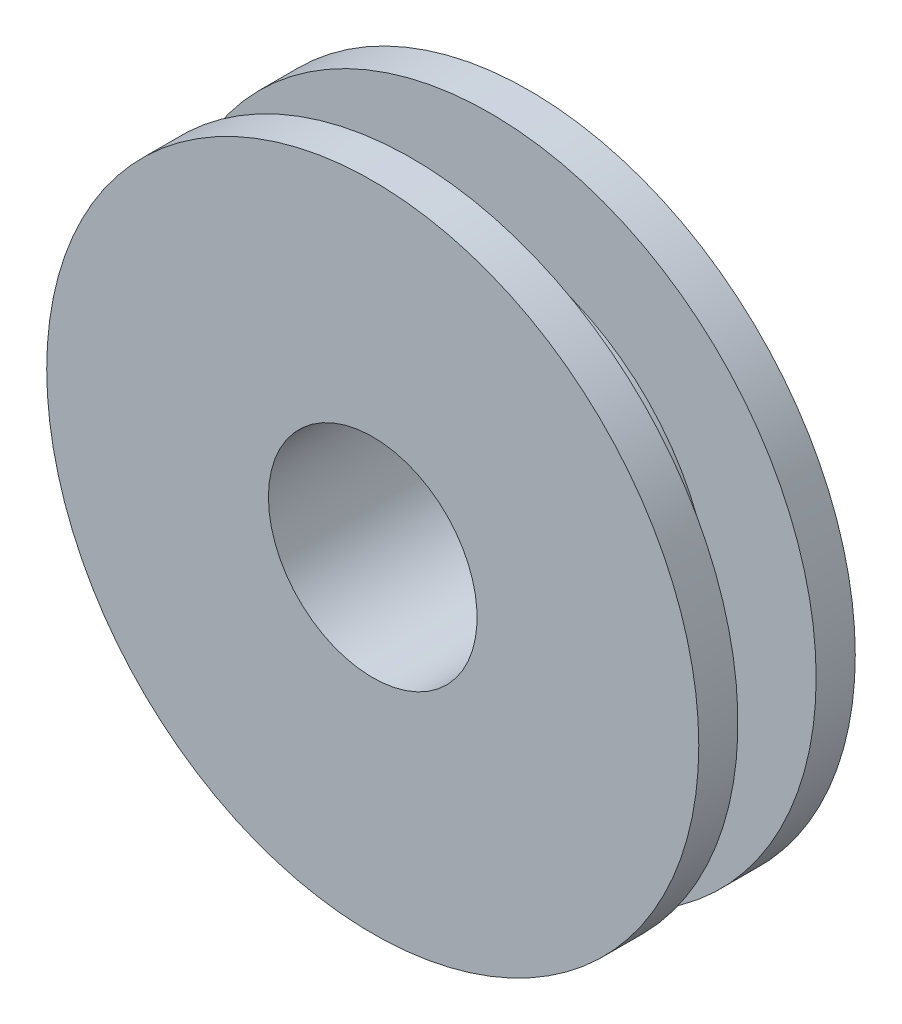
from build123d import *

# Parameters (mm, degrees)
DIAM_R         = 12.5
CYLINDRE_DEPTH = 6
ESQUISSE3_W    = 5
ESQUISSE3_H    = 3
ESQUISSE4_R    = 6.5
BOSSAGE_DEPTH  = 0.5
BOSSAGE_DRAFT  = -45
ESQUISSE7_R    = 4
PER_AGE_DEPTH  = 19.834808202


with BuildPart() as part:
    # diam → cylindre (new body)
    with BuildSketch(Plane.XY):
        Circle(DIAM_R)
    extrude(amount=CYLINDRE_DEPTH)

    # Esquisse3 → gorge (revolve, cut)
    with BuildSketch(Plane(origin=(0, 0, 0), x_dir=(1, 0, 0), z_dir=(0, 1, 0)), mode=Mode.PRIVATE) as gorge_sk:
        with Locations((11, -3)):
            Rectangle(ESQUISSE3_W, ESQUISSE3_H)
    revolve(gorge_sk.sketch.rotate(Axis((0, 0, 0), (0, 0, 1)), 180), axis=Axis((0, 0, 0), (0, 0, 1)), mode=Mode.SUBTRACT)


with BuildPart() as bossage_tool:
    # Esquisse4 → bossage (with draft: the straight prism first)
    with BuildSketch(Plane.XY):
        Circle(ESQUISSE4_R)
    extrude(amount=-BOSSAGE_DEPTH)
    # bossage: the draft: its side faces are tilted about the plane it starts from
    bossage_sides = [bossage_tool.faces().sort_by_distance(p)[0] for p in [
        (-6.5, 0, -0.25),
    ]]
    draft(bossage_sides, Plane.XY, BOSSAGE_DRAFT)


with BuildPart() as part_1:
    add(part.part)

    # bossage: add bossage_tool
    add(bossage_tool.part)

    # Esquisse7 → per_age (cut, through all)
    with BuildSketch(Plane(origin=(0, 0, -0.5), x_dir=(-1, 0, 0), z_dir=(0, 0, -1))):
        Circle(ESQUISSE7_R)
    extrude(amount=-PER_AGE_DEPTH, mode=Mode.SUBTRACT)


solid = part_1.part
